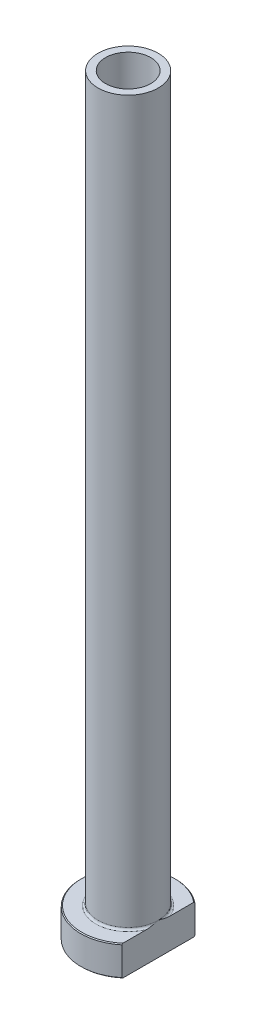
ISO-10303-21;
HEADER;
FILE_DESCRIPTION(('STEP AP214'),'2;1');
FILE_NAME('part.step','',(''),(''),'','','');
FILE_SCHEMA(('AUTOMOTIVE_DESIGN { 1 0 10303 214 1 1 1 1 }'));
ENDSEC;
DATA;
#1=APPLICATION_CONTEXT('core data for automotive mechanical design processes');
#2=APPLICATION_PROTOCOL_DEFINITION('international standard','automotive_design',2000,#1);
#3=PRODUCT_CONTEXT('',#1,'mechanical');
#4=PRODUCT('Part','Part','',(#3));
#5=PRODUCT_RELATED_PRODUCT_CATEGORY('part','',(#4));
#6=PRODUCT_DEFINITION_FORMATION('','',#4);
#7=PRODUCT_DEFINITION_CONTEXT('part definition',#1,'design');
#8=PRODUCT_DEFINITION('design','',#6,#7);
#9=PRODUCT_DEFINITION_SHAPE('','',#8);
#10=(LENGTH_UNIT() NAMED_UNIT(*) SI_UNIT(.MILLI.,.METRE.));
#11=(NAMED_UNIT(*) PLANE_ANGLE_UNIT() SI_UNIT($,.RADIAN.));
#12=(NAMED_UNIT(*) SI_UNIT($,.STERADIAN.) SOLID_ANGLE_UNIT());
#13=UNCERTAINTY_MEASURE_WITH_UNIT(LENGTH_MEASURE(1.E-05),#10,'distance_accuracy_value','');
#14=(GEOMETRIC_REPRESENTATION_CONTEXT(3) GLOBAL_UNCERTAINTY_ASSIGNED_CONTEXT((#13)) GLOBAL_UNIT_ASSIGNED_CONTEXT((#10,
#11,#12)) REPRESENTATION_CONTEXT('',''));
#15=CARTESIAN_POINT('',(0.,0.,0.));
#16=DIRECTION('',(0.,0.,1.));
#17=DIRECTION('',(1.,0.,0.));
#18=AXIS2_PLACEMENT_3D('',#15,#16,#17);
#19=CARTESIAN_POINT('',(0.,92.1876809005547,0.));
#20=DIRECTION('',(0.,1.,0.));
#21=DIRECTION('',(0.,0.,1.));
#22=AXIS2_PLACEMENT_3D('',#19,#20,#21);
#23=CYLINDRICAL_SURFACE('',#22,5.25);
#24=CARTESIAN_POINT('',(0.,175.,0.));
#25=DIRECTION('',(0.,1.,0.));
#26=DIRECTION('',(0.,0.,1.));
#27=AXIS2_PLACEMENT_3D('',#24,#25,#26);
#28=CIRCLE('',#27,5.25);
#29=CARTESIAN_POINT('',(0.,175.,5.25));
#30=VERTEX_POINT('',#29);
#31=EDGE_CURVE('E167',#30,#30,#28,.T.);
#32=ORIENTED_EDGE('',*,*,#31,.T.);
#33=EDGE_LOOP('',(#32));
#34=FACE_BOUND('',#33,.T.);
#35=CARTESIAN_POINT('',(0.,120.,0.));
#36=DIRECTION('',(0.,1.,0.));
#37=DIRECTION('',(0.,0.,1.));
#38=AXIS2_PLACEMENT_3D('',#35,#36,#37);
#39=CIRCLE('',#38,5.25);
#40=CARTESIAN_POINT('',(0.,120.,5.25));
#41=VERTEX_POINT('',#40);
#42=EDGE_CURVE('E170',#41,#41,#39,.T.);
#43=ORIENTED_EDGE('',*,*,#42,.F.);
#44=EDGE_LOOP('',(#43));
#45=FACE_BOUND('',#44,.T.);
#46=ADVANCED_FACE('F32',(#34,#45),#23,.F.);
#47=CARTESIAN_POINT('',(-5.25,175.,0.));
#48=DIRECTION('',(0.,1.,0.));
#49=DIRECTION('',(0.,0.,1.));
#50=AXIS2_PLACEMENT_3D('',#47,#48,#49);
#51=PLANE('',#50);
#52=CARTESIAN_POINT('',(0.,175.,0.));
#53=DIRECTION('',(0.,1.,0.));
#54=DIRECTION('',(0.,0.,1.));
#55=AXIS2_PLACEMENT_3D('',#52,#53,#54);
#56=CIRCLE('',#55,7.00000000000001);
#57=CARTESIAN_POINT('',(0.,175.,7.00000000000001));
#58=VERTEX_POINT('',#57);
#59=EDGE_CURVE('E174',#58,#58,#56,.T.);
#60=ORIENTED_EDGE('',*,*,#59,.T.);
#61=EDGE_LOOP('',(#60));
#62=FACE_BOUND('',#61,.T.);
#63=ORIENTED_EDGE('',*,*,#31,.F.);
#64=EDGE_LOOP('',(#63));
#65=FACE_BOUND('',#64,.T.);
#66=ADVANCED_FACE('F157',(#62,#65),#51,.T.);
#67=CARTESIAN_POINT('',(0.,92.1876809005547,0.));
#68=DIRECTION('',(0.,1.,0.));
#69=DIRECTION('',(0.,0.,1.));
#70=AXIS2_PLACEMENT_3D('',#67,#68,#69);
#71=CYLINDRICAL_SURFACE('',#70,7.);
#72=CARTESIAN_POINT('',(0.,7.50000000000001,0.));
#73=DIRECTION('',(0.,1.,0.));
#74=DIRECTION('',(0.,0.,1.));
#75=AXIS2_PLACEMENT_3D('',#72,#73,#74);
#76=CIRCLE('',#75,7.);
#77=CARTESIAN_POINT('',(7.,7.50000000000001,0.));
#78=VERTEX_POINT('',#77);
#79=EDGE_CURVE('E180',#78,#78,#76,.T.);
#80=ORIENTED_EDGE('',*,*,#79,.T.);
#81=EDGE_LOOP('',(#80));
#82=FACE_BOUND('',#81,.T.);
#83=ORIENTED_EDGE('',*,*,#59,.F.);
#84=EDGE_LOOP('',(#83));
#85=FACE_BOUND('',#84,.T.);
#86=ADVANCED_FACE('F162',(#82,#85),#71,.T.);
#87=CARTESIAN_POINT('',(-6.99999999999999,7.,0.));
#88=DIRECTION('',(0.,1.,0.));
#89=DIRECTION('',(0.,0.,1.));
#90=AXIS2_PLACEMENT_3D('',#87,#88,#89);
#91=PLANE('',#90);
#92=DIRECTION('',(0.,0.,1.));
#93=VECTOR('',#92,1.);
#94=CARTESIAN_POINT('',(6.99999999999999,7.,0.));
#95=LINE('',#94,#93);
#96=CARTESIAN_POINT('',(7.,7.,-8.22435407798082));
#97=VERTEX_POINT('',#96);
#98=CARTESIAN_POINT('',(6.99999999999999,7.,-2.69258240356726));
#99=VERTEX_POINT('',#98);
#100=EDGE_CURVE('E54',#97,#99,#95,.T.);
#101=ORIENTED_EDGE('',*,*,#100,.F.);
#102=CARTESIAN_POINT('',(0.,7.,0.));
#103=DIRECTION('',(0.,1.,0.));
#104=DIRECTION('',(0.,0.,1.));
#105=AXIS2_PLACEMENT_3D('',#102,#103,#104);
#106=CIRCLE('',#105,10.8);
#107=CARTESIAN_POINT('',(6.99999999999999,7.,8.22435407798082));
#108=VERTEX_POINT('',#107);
#109=EDGE_CURVE('E186',#97,#108,#106,.T.);
#110=ORIENTED_EDGE('',*,*,#109,.T.);
#111=CARTESIAN_POINT('',(6.99999999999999,7.,2.69258240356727));
#112=VERTEX_POINT('',#111);
#113=EDGE_CURVE('E134',#112,#108,#95,.T.);
#114=ORIENTED_EDGE('',*,*,#113,.F.);
#115=CARTESIAN_POINT('',(0.,7.,0.));
#116=DIRECTION('',(0.,1.,0.));
#117=DIRECTION('',(0.,0.,1.));
#118=AXIS2_PLACEMENT_3D('',#115,#116,#117);
#119=CIRCLE('',#118,7.5);
#120=EDGE_CURVE('E183',#112,#99,#119,.F.);
#121=ORIENTED_EDGE('',*,*,#120,.T.);
#122=EDGE_LOOP('',(#101,#110,#114,#121));
#123=FACE_BOUND('',#122,.T.);
#124=ADVANCED_FACE('F197',(#123),#91,.T.);
#125=CARTESIAN_POINT('',(0.,92.1876809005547,0.));
#126=DIRECTION('',(0.,1.,0.));
#127=DIRECTION('',(0.,0.,1.));
#128=AXIS2_PLACEMENT_3D('',#125,#126,#127);
#129=CYLINDRICAL_SURFACE('',#128,11.);
#130=DIRECTION('',(0.,-1.,0.));
#131=VECTOR('',#130,1.);
#132=CARTESIAN_POINT('',(6.99999999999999,175.,8.48528137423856));
#133=LINE('',#132,#131);
#134=CARTESIAN_POINT('',(6.99999999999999,6.8,8.48528137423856));
#135=VERTEX_POINT('',#134);
#136=CARTESIAN_POINT('',(6.99999999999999,0.199999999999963,8.48528137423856));
#137=VERTEX_POINT('',#136);
#138=EDGE_CURVE('E82',#135,#137,#133,.T.);
#139=ORIENTED_EDGE('',*,*,#138,.F.);
#140=CARTESIAN_POINT('',(0.,6.8,0.));
#141=DIRECTION('',(0.,1.,0.));
#142=DIRECTION('',(0.,0.,1.));
#143=AXIS2_PLACEMENT_3D('',#140,#141,#142);
#144=CIRCLE('',#143,11.);
#145=CARTESIAN_POINT('',(7.,6.8,-8.48528137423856));
#146=VERTEX_POINT('',#145);
#147=EDGE_CURVE('E95',#135,#146,#144,.F.);
#148=ORIENTED_EDGE('',*,*,#147,.T.);
#149=DIRECTION('',(0.,-1.,0.));
#150=VECTOR('',#149,1.);
#151=CARTESIAN_POINT('',(7.,175.,-8.48528137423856));
#152=LINE('',#151,#150);
#153=CARTESIAN_POINT('',(7.,0.199999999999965,-8.48528137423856));
#154=VERTEX_POINT('',#153);
#155=EDGE_CURVE('E192',#146,#154,#152,.T.);
#156=ORIENTED_EDGE('',*,*,#155,.T.);
#157=CARTESIAN_POINT('',(0.,0.199999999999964,0.));
#158=DIRECTION('',(0.,-1.,0.));
#159=DIRECTION('',(0.,0.,-1.));
#160=AXIS2_PLACEMENT_3D('',#157,#158,#159);
#161=CIRCLE('',#160,11.);
#162=EDGE_CURVE('E98',#154,#137,#161,.F.);
#163=ORIENTED_EDGE('',*,*,#162,.T.);
#164=EDGE_LOOP('',(#139,#148,#156,#163));
#165=FACE_BOUND('',#164,.T.);
#166=ADVANCED_FACE('F190',(#165),#129,.T.);
#167=CARTESIAN_POINT('',(-11.,0.,0.));
#168=DIRECTION('',(0.,-1.,0.));
#169=DIRECTION('',(0.,0.,-1.));
#170=AXIS2_PLACEMENT_3D('',#167,#168,#169);
#171=PLANE('',#170);
#172=CARTESIAN_POINT('',(0.,0.,0.));
#173=DIRECTION('',(0.,-1.,0.));
#174=DIRECTION('',(0.,0.,-1.));
#175=AXIS2_PLACEMENT_3D('',#172,#173,#174);
#176=CIRCLE('',#175,6.00000000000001);
#177=CARTESIAN_POINT('',(0.,0.,-6.00000000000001));
#178=VERTEX_POINT('',#177);
#179=EDGE_CURVE('E40',#178,#178,#176,.F.);
#180=ORIENTED_EDGE('',*,*,#179,.T.);
#181=EDGE_LOOP('',(#180));
#182=FACE_BOUND('',#181,.T.);
#183=DIRECTION('',(0.,0.,-1.));
#184=VECTOR('',#183,1.);
#185=CARTESIAN_POINT('',(6.99999999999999,0.,8.48528137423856));
#186=LINE('',#185,#184);
#187=CARTESIAN_POINT('',(6.99999999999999,0.,8.22435407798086));
#188=VERTEX_POINT('',#187);
#189=CARTESIAN_POINT('',(7.,0.,-8.22435407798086));
#190=VERTEX_POINT('',#189);
#191=EDGE_CURVE('E47',#188,#190,#186,.T.);
#192=ORIENTED_EDGE('',*,*,#191,.F.);
#193=CARTESIAN_POINT('',(0.,0.,0.));
#194=DIRECTION('',(0.,-1.,0.));
#195=DIRECTION('',(0.,0.,-1.));
#196=AXIS2_PLACEMENT_3D('',#193,#194,#195);
#197=CIRCLE('',#196,10.8);
#198=EDGE_CURVE('E92',#188,#190,#197,.T.);
#199=ORIENTED_EDGE('',*,*,#198,.T.);
#200=EDGE_LOOP('',(#192,#199));
#201=FACE_BOUND('',#200,.T.);
#202=ADVANCED_FACE('F91',(#182,#201),#171,.T.);
#203=CARTESIAN_POINT('',(0.,92.1876809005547,0.));
#204=DIRECTION('',(0.,1.,0.));
#205=DIRECTION('',(0.,0.,1.));
#206=AXIS2_PLACEMENT_3D('',#203,#204,#205);
#207=CYLINDRICAL_SURFACE('',#206,5.5);
#208=CARTESIAN_POINT('',(0.,0.499999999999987,0.));
#209=DIRECTION('',(0.,-1.,0.));
#210=DIRECTION('',(0.,0.,-1.));
#211=AXIS2_PLACEMENT_3D('',#208,#209,#210);
#212=CIRCLE('',#211,5.5);
#213=CARTESIAN_POINT('',(0.,0.499999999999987,-5.5));
#214=VERTEX_POINT('',#213);
#215=EDGE_CURVE('E11',#214,#214,#212,.T.);
#216=ORIENTED_EDGE('',*,*,#215,.T.);
#217=EDGE_LOOP('',(#216));
#218=FACE_BOUND('',#217,.T.);
#219=CARTESIAN_POINT('',(0.,108.,0.));
#220=DIRECTION('',(0.,1.,0.));
#221=DIRECTION('',(0.,0.,1.));
#222=AXIS2_PLACEMENT_3D('',#219,#220,#221);
#223=CIRCLE('',#222,5.5);
#224=CARTESIAN_POINT('',(0.,108.,5.5));
#225=VERTEX_POINT('',#224);
#226=EDGE_CURVE('E172',#225,#225,#223,.T.);
#227=ORIENTED_EDGE('',*,*,#226,.T.);
#228=EDGE_LOOP('',(#227));
#229=FACE_BOUND('',#228,.T.);
#230=ADVANCED_FACE('F215',(#218,#229),#207,.F.);
#231=CARTESIAN_POINT('',(0.,108.,0.));
#232=DIRECTION('',(0.,-1.,0.));
#233=DIRECTION('',(0.,0.,-1.));
#234=AXIS2_PLACEMENT_3D('',#231,#232,#233);
#235=CONICAL_SURFACE('',#234,5.5,0.0208303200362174);
#236=ORIENTED_EDGE('',*,*,#42,.T.);
#237=EDGE_LOOP('',(#236));
#238=FACE_BOUND('',#237,.T.);
#239=ORIENTED_EDGE('',*,*,#226,.F.);
#240=EDGE_LOOP('',(#239));
#241=FACE_BOUND('',#240,.T.);
#242=ADVANCED_FACE('F111',(#238,#241),#235,.F.);
#243=CARTESIAN_POINT('',(0.,7.50000000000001,0.));
#244=DIRECTION('',(0.,1.,0.));
#245=DIRECTION('',(0.,0.,1.));
#246=AXIS2_PLACEMENT_3D('',#243,#244,#245);
#247=TOROIDAL_SURFACE('',#246,7.5,0.5);
#248=ORIENTED_EDGE('',*,*,#120,.F.);
#249=CARTESIAN_POINT('',(7.,7.50000000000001,0.));
#250=CARTESIAN_POINT('',(7.,7.50000080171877,-1.25568479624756E-10));
#251=CARTESIAN_POINT('',(7.,7.50000160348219,2.9022028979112E-07));
#252=CARTESIAN_POINT('',(7.,7.50000310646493,1.10846445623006E-06));
#253=CARTESIAN_POINT('',(7.,7.50000379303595,1.65470117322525E-06));
#254=CARTESIAN_POINT('',(7.,7.50000521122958,2.96102760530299E-06));
#255=CARTESIAN_POINT('',(7.,7.50000592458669,3.74204187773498E-06));
#256=CARTESIAN_POINT('',(7.,7.50000721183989,5.36891885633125E-06));
#257=CARTESIAN_POINT('',(7.,7.50000778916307,6.21226355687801E-06));
#258=CARTESIAN_POINT('',(7.,7.50000990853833,9.44889721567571E-06));
#259=CARTESIAN_POINT('',(7.,7.50001133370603,1.19224915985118E-05));
#260=CARTESIAN_POINT('',(7.,7.50001370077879,1.68453050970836E-05));
#261=CARTESIAN_POINT('',(7.,7.50001467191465,1.92810864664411E-05));
#262=CARTESIAN_POINT('',(7.,7.5000187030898,2.95057529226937E-05));
#263=CARTESIAN_POINT('',(7.,7.50002167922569,3.73333827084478E-05));
#264=CARTESIAN_POINT('',(7.,7.5000261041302,5.21820419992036E-05));
#265=CARTESIAN_POINT('',(7.,7.50002771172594,5.91556020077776E-05));
#266=CARTESIAN_POINT('',(7.,7.50003935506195,0.000110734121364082));
#267=CARTESIAN_POINT('',(7.,7.50004810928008,0.000155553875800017));
#268=CARTESIAN_POINT('',(6.99999999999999,7.50008643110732,0.00033254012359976));
#269=CARTESIAN_POINT('',(6.99999999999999,7.50012307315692,0.000463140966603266));
#270=CARTESIAN_POINT('',(7.,7.50026565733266,0.000980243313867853));
#271=CARTESIAN_POINT('',(7.,7.50036696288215,0.00136762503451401));
#272=CARTESIAN_POINT('',(6.99999999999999,7.50077257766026,0.00290683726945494));
#273=CARTESIAN_POINT('',(6.99999999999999,7.5010826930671,0.00405753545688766));
#274=CARTESIAN_POINT('',(7.,7.50237341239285,0.00885983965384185));
#275=CARTESIAN_POINT('',(7.,7.50334676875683,0.0125128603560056));
#276=CARTESIAN_POINT('',(6.99999999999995,7.51627189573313,0.0610038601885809));
#277=CARTESIAN_POINT('',(6.99999999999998,7.52827280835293,0.105832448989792));
#278=CARTESIAN_POINT('',(7.00000000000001,7.551709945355,0.193693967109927));
#279=CARTESIAN_POINT('',(7.,7.56314936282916,0.236726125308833));
#280=CARTESIAN_POINT('',(6.99999999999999,7.58740418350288,0.328321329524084));
#281=CARTESIAN_POINT('',(6.99999999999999,7.60020832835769,0.376887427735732));
#282=CARTESIAN_POINT('',(7.,7.62578161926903,0.474605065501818));
#283=CARTESIAN_POINT('',(7.,7.63854879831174,0.523757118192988));
#284=CARTESIAN_POINT('',(6.99999999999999,7.66904753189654,0.642366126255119));
#285=CARTESIAN_POINT('',(7.,7.68665961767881,0.711854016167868));
#286=CARTESIAN_POINT('',(7.,7.72074501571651,0.849103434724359));
#287=CARTESIAN_POINT('',(7.,7.73723627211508,0.916860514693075));
#288=CARTESIAN_POINT('',(7.,7.79038156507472,1.1410421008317));
#289=CARTESIAN_POINT('',(7.,7.82528973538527,1.29788860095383));
#290=CARTESIAN_POINT('',(7.,7.88862298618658,1.61471917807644));
#291=CARTESIAN_POINT('',(7.,7.91697354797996,1.77471883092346));
#292=CARTESIAN_POINT('',(7.,7.95258292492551,2.02253505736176));
#293=CARTESIAN_POINT('',(7.,7.96355251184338,2.10981398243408));
#294=CARTESIAN_POINT('',(7.,7.98165287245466,2.28476193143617));
#295=CARTESIAN_POINT('',(7.,7.98878459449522,2.37243085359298));
#296=CARTESIAN_POINT('',(7.,7.99822919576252,2.54760327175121));
#297=CARTESIAN_POINT('',(7.,8.00056589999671,2.63510541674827));
#298=CARTESIAN_POINT('',(7.,7.99919996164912,2.81004074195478));
#299=CARTESIAN_POINT('',(7.,7.99550272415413,2.89747391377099));
#300=CARTESIAN_POINT('',(7.,7.98391011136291,3.02882076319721));
#301=CARTESIAN_POINT('',(7.,7.9789723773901,3.0729968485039));
#302=CARTESIAN_POINT('',(7.,7.96665453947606,3.16105400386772));
#303=CARTESIAN_POINT('',(7.,7.9592724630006,3.20493480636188));
#304=CARTESIAN_POINT('',(7.,7.94168688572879,3.29163191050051));
#305=CARTESIAN_POINT('',(7.,7.93151559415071,3.3344546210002));
#306=CARTESIAN_POINT('',(7.,7.90768392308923,3.41909658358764));
#307=CARTESIAN_POINT('',(7.,7.89402748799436,3.46091691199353));
#308=CARTESIAN_POINT('',(7.,7.86214701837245,3.54331777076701));
#309=CARTESIAN_POINT('',(7.,7.84387618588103,3.58388050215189));
#310=CARTESIAN_POINT('',(7.,7.80145892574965,3.66184445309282));
#311=CARTESIAN_POINT('',(7.,7.77733569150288,3.69925738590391));
#312=CARTESIAN_POINT('',(7.,7.73714014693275,3.74836513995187));
#313=CARTESIAN_POINT('',(7.,7.72423208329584,3.76263695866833));
#314=CARTESIAN_POINT('',(7.,7.69673765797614,3.78951670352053));
#315=CARTESIAN_POINT('',(7.,7.68215013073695,3.80212346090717));
#316=CARTESIAN_POINT('',(7.,7.65099843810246,3.82514624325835));
#317=CARTESIAN_POINT('',(7.,7.63441049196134,3.83553078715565));
#318=CARTESIAN_POINT('',(7.,7.59955798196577,3.8529401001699));
#319=CARTESIAN_POINT('',(7.,7.58129885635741,3.85997533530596));
#320=CARTESIAN_POINT('',(7.,7.54906837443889,3.86837810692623));
#321=CARTESIAN_POINT('',(7.,7.53536870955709,3.87079233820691));
#322=CARTESIAN_POINT('',(7.,7.50775756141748,3.87325240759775));
#323=CARTESIAN_POINT('',(7.,7.4938461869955,3.87329942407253));
#324=CARTESIAN_POINT('',(7.,7.46623771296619,3.87102093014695));
#325=CARTESIAN_POINT('',(7.,7.45254041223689,3.8686978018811));
#326=CARTESIAN_POINT('',(7.,7.42569741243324,3.86188775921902));
#327=CARTESIAN_POINT('',(7.,7.41255212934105,3.85739924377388));
#328=CARTESIAN_POINT('',(7.,7.3825931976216,3.84468786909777));
#329=CARTESIAN_POINT('',(7.,7.36610215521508,3.83570823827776));
#330=CARTESIAN_POINT('',(7.,7.33476729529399,3.81523202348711));
#331=CARTESIAN_POINT('',(7.,7.31992737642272,3.80372966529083));
#332=CARTESIAN_POINT('',(7.,7.28371925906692,3.77170797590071));
#333=CARTESIAN_POINT('',(7.,7.26356272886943,3.74983059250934));
#334=CARTESIAN_POINT('',(7.,7.22671696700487,3.70338283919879));
#335=CARTESIAN_POINT('',(7.,7.2100336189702,3.67880800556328));
#336=CARTESIAN_POINT('',(7.,7.18026553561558,3.62921731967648));
#337=CARTESIAN_POINT('',(7.,7.16704475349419,3.60428175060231));
#338=CARTESIAN_POINT('',(7.,7.14275069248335,3.55337478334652));
#339=CARTESIAN_POINT('',(7.,7.1316794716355,3.52740242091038));
#340=CARTESIAN_POINT('',(7.,7.10104499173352,3.44809573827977));
#341=CARTESIAN_POINT('',(7.,7.08424174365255,3.39369851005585));
#342=CARTESIAN_POINT('',(7.,7.05431378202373,3.27667221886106));
#343=CARTESIAN_POINT('',(7.,7.04191718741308,3.21386807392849));
#344=CARTESIAN_POINT('',(7.,7.02234605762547,3.08735184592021));
#345=CARTESIAN_POINT('',(7.,7.01518234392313,3.0236381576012));
#346=CARTESIAN_POINT('',(7.,7.00517826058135,2.8977900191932));
#347=CARTESIAN_POINT('',(7.,7.00221627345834,2.8356646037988));
#348=CARTESIAN_POINT('',(7.,6.99952325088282,2.71160626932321));
#349=CARTESIAN_POINT('',(7.,6.99977918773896,2.64967358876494));
#350=CARTESIAN_POINT('',(7.,7.00377761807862,2.49407814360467));
#351=CARTESIAN_POINT('',(7.,7.00924384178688,2.40046113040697));
#352=CARTESIAN_POINT('',(7.,7.02494106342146,2.21367396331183));
#353=CARTESIAN_POINT('',(7.,7.0351710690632,2.12050372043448));
#354=CARTESIAN_POINT('',(7.,7.05969765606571,1.93249035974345));
#355=CARTESIAN_POINT('',(7.,7.07408383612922,1.83765914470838));
#356=CARTESIAN_POINT('',(7.,7.1060330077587,1.6482934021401));
#357=CARTESIAN_POINT('',(7.,7.12360402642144,1.55376025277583));
#358=CARTESIAN_POINT('',(7.,7.16806468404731,1.33086107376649));
#359=CARTESIAN_POINT('',(7.,7.19601783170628,1.20270896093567));
#360=CARTESIAN_POINT('',(7.,7.25475947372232,0.948586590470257));
#361=CARTESIAN_POINT('',(7.,7.28551257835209,0.822607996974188));
#362=CARTESIAN_POINT('',(7.,7.33123897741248,0.64133402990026));
#363=CARTESIAN_POINT('',(7.,7.34543722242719,0.585840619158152));
#364=CARTESIAN_POINT('',(6.99999999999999,7.37418243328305,0.474686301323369));
#365=CARTESIAN_POINT('',(6.99999999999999,7.38873064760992,0.419025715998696));
#366=CARTESIAN_POINT('',(7.,7.41873357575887,0.305011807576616));
#367=CARTESIAN_POINT('',(7.,7.43419762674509,0.246660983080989));
#368=CARTESIAN_POINT('',(6.99999999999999,7.46502361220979,0.130933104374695));
#369=CARTESIAN_POINT('',(6.99999999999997,7.48038319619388,0.073555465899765));
#370=CARTESIAN_POINT('',(7.,7.49665455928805,0.0125077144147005));
#371=CARTESIAN_POINT('',(7.,7.49762931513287,0.00884956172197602));
#372=CARTESIAN_POINT('',(6.99999999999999,7.49892036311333,0.00404608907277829));
#373=CARTESIAN_POINT('',(6.99999999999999,7.49922940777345,0.00289935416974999));
#374=CARTESIAN_POINT('',(7.,7.49963371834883,0.00136508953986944));
#375=CARTESIAN_POINT('',(7.,7.49973476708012,0.000978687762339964));
#376=CARTESIAN_POINT('',(6.99999999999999,7.49987704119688,0.00046273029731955));
#377=CARTESIAN_POINT('',(6.99999999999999,7.4999136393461,0.000332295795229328));
#378=CARTESIAN_POINT('',(7.,7.49995192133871,0.000155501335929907));
#379=CARTESIAN_POINT('',(7.,7.49996067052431,0.000110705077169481));
#380=CARTESIAN_POINT('',(7.,7.49997230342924,5.91504871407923E-05));
#381=CARTESIAN_POINT('',(7.,7.49997390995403,5.21782476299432E-05));
#382=CARTESIAN_POINT('',(7.,7.49997833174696,3.73322821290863E-05));
#383=CARTESIAN_POINT('',(7.,7.49998130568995,2.95059555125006E-05));
#384=CARTESIAN_POINT('',(7.,7.49998533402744,1.92826357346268E-05));
#385=CARTESIAN_POINT('',(7.,7.49998630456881,1.68469531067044E-05));
#386=CARTESIAN_POINT('',(7.,7.49998867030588,1.19242379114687E-05));
#387=CARTESIAN_POINT('',(7.,7.49999009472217,9.45063101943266E-06));
#388=CARTESIAN_POINT('',(7.,7.49999221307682,6.21386478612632E-06));
#389=CARTESIAN_POINT('',(7.,7.4999927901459,5.37045339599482E-06));
#390=CARTESIAN_POINT('',(7.,7.49999407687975,3.74339717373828E-06));
#391=CARTESIAN_POINT('',(7.,7.49999478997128,2.96226879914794E-06));
#392=CARTESIAN_POINT('',(7.,7.49999620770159,1.65567359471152E-06));
#393=CARTESIAN_POINT('',(7.,7.49999689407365,1.10929204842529E-06));
#394=CARTESIAN_POINT('',(7.,7.49999839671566,2.90683225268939E-07));
#395=CARTESIAN_POINT('',(7.,7.49999919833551,1.25561410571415E-10));
#396=CARTESIAN_POINT('',(7.,7.50000000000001,0.));
#397=B_SPLINE_CURVE_WITH_KNOTS('',3,(#249,#250,#251,#252,#253,#254,#255,#256,#257,#258,#259,
#260,#261,#262,#263,#264,#265,#266,#267,#268,#269,#270,#271,#272,#273,#274,#275,#276,#277,#278,
#279,#280,#281,#282,#283,#284,#285,#286,#287,#288,#289,#290,#291,#292,#293,#294,#295,#296,#297,
#298,#299,#300,#301,#302,#303,#304,#305,#306,#307,#308,#309,#310,#311,#312,#313,#314,#315,#316,
#317,#318,#319,#320,#321,#322,#323,#324,#325,#326,#327,#328,#329,#330,#331,#332,#333,#334,#335,
#336,#337,#338,#339,#340,#341,#342,#343,#344,#345,#346,#347,#348,#349,#350,#351,#352,#353,#354,
#355,#356,#357,#358,#359,#360,#361,#362,#363,#364,#365,#366,#367,#368,#369,#370,#371,#372,#373,
#374,#375,#376,#377,#378,#379,#380,#381,#382,#383,#384,#385,#386,#387,#388,#389,#390,#391,#392,
#393,#394,#395,#396),.UNSPECIFIED.,.T.,.F.,(4,2,2,2,2,2,2,2,2,2,2,2,2,2,2,2,2,2,2,2,2,2,2,2,2,2,
2,2,2,2,2,2,2,2,2,2,2,2,2,2,2,2,2,2,2,2,2,2,2,2,2,2,2,2,2,2,2,2,2,2,2,2,2,2,2,2,2,2,2,2,2,2,2,
4),(0.,2.42201381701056E-06,5.0530479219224E-06,8.20814016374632E-06,1.12722920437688E-05,
1.98044004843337E-05,2.76642048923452E-05,5.27403832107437E-05,7.41830767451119E-05,
0.000211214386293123,0.000617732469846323,0.00181938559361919,0.00539412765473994,
0.016736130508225,0.155952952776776,0.2895341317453,0.440210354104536,0.592559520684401,
0.807611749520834,1.0168149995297,1.49878389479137,1.98598665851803,2.24981935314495,
2.5135868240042,2.77604050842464,3.03825922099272,3.17156039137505,3.3049693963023,
3.43689837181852,3.5686786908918,3.70185328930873,3.83450849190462,3.89212877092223,
3.94978928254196,4.00821928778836,4.06646549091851,4.10801107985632,4.14953598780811,
4.19101920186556,4.23253313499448,4.28854866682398,4.34469377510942,4.4334341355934,
4.52232362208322,4.60686785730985,4.69149264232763,4.86185145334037,5.05362927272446,
5.24580256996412,5.43229132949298,5.61802533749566,5.89918385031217,6.18028382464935,
6.46796485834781,6.75638131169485,7.14981284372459,7.53882346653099,7.71066604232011,
7.88325629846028,8.0643532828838,8.24254095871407,8.25389891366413,8.25746134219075,
8.25865995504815,8.25906595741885,8.25920291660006,8.25922435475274,8.25924942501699,
8.25925728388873,8.25926581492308,8.25926887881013,8.25927203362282,8.25927466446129,
8.25927708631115),.UNSPECIFIED.);
#398=EDGE_CURVE('E126',#112,#78,#397,.T.);
#399=ORIENTED_EDGE('',*,*,#398,.T.);
#400=ORIENTED_EDGE('',*,*,#79,.F.);
#401=CARTESIAN_POINT('',(7.,7.50000000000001,0.));
#402=CARTESIAN_POINT('',(7.,7.49999919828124,1.25569885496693E-10));
#403=CARTESIAN_POINT('',(7.,7.49999839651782,-2.90220288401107E-07));
#404=CARTESIAN_POINT('',(7.,7.49999689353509,-1.10846445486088E-06));
#405=CARTESIAN_POINT('',(7.,7.49999620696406,-1.65470117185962E-06));
#406=CARTESIAN_POINT('',(7.,7.49999478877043,-2.96102760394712E-06));
#407=CARTESIAN_POINT('',(7.,7.49999407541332,-3.7420418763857E-06));
#408=CARTESIAN_POINT('',(7.,7.49999278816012,-5.36891885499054E-06));
#409=CARTESIAN_POINT('',(7.,7.49999221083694,-6.2122635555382E-06));
#410=CARTESIAN_POINT('',(7.,7.49999009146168,-9.44889721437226E-06));
#411=CARTESIAN_POINT('',(7.,7.49998866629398,-1.19224915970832E-05));
#412=CARTESIAN_POINT('',(7.,7.49998629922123,-1.68453050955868E-05));
#413=CARTESIAN_POINT('',(7.,7.49998532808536,-1.92810864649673E-05));
#414=CARTESIAN_POINT('',(7.,7.49998129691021,-2.950575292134E-05));
#415=CARTESIAN_POINT('',(7.,7.49997832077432,-3.73333827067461E-05));
#416=CARTESIAN_POINT('',(7.,7.49997389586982,-5.21820419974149E-05));
#417=CARTESIAN_POINT('',(7.,7.49997228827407,-5.91556020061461E-05));
#418=CARTESIAN_POINT('',(7.,7.49996064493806,-0.000110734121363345));
#419=CARTESIAN_POINT('',(7.,7.49995189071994,-0.000155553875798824));
#420=CARTESIAN_POINT('',(6.99999999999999,7.49991356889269,-0.000332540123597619));
#421=CARTESIAN_POINT('',(6.99999999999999,7.49987692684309,-0.00046314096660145));
#422=CARTESIAN_POINT('',(7.,7.49973434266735,-0.000980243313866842));
#423=CARTESIAN_POINT('',(7.,7.49963303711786,-0.00136762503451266));
#424=CARTESIAN_POINT('',(6.99999999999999,7.49922742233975,-0.0029068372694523));
#425=CARTESIAN_POINT('',(6.99999999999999,7.49891730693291,-0.00405753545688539));
#426=CARTESIAN_POINT('',(7.,7.49762658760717,-0.00885983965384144));
#427=CARTESIAN_POINT('',(7.,7.49665323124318,-0.0125128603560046));
#428=CARTESIAN_POINT('',(6.99999999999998,7.48372810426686,-0.0610038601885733));
#429=CARTESIAN_POINT('',(6.99999999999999,7.47172719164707,-0.105832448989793));
#430=CARTESIAN_POINT('',(7.,7.44829005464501,-0.193693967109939));
#431=CARTESIAN_POINT('',(7.,7.43685063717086,-0.236726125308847));
#432=CARTESIAN_POINT('',(6.99999999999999,7.41259581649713,-0.328321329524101));
#433=CARTESIAN_POINT('',(7.,7.39979167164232,-0.376887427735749));
#434=CARTESIAN_POINT('',(7.,7.37421838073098,-0.474605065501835));
#435=CARTESIAN_POINT('',(7.,7.36145120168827,-0.523757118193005));
#436=CARTESIAN_POINT('',(7.,7.33095246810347,-0.642366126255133));
#437=CARTESIAN_POINT('',(7.,7.3133403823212,-0.711854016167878));
#438=CARTESIAN_POINT('',(7.,7.2792549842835,-0.849103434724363));
#439=CARTESIAN_POINT('',(7.,7.26276372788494,-0.916860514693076));
#440=CARTESIAN_POINT('',(7.,7.20961843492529,-1.1410421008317));
#441=CARTESIAN_POINT('',(7.,7.17471026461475,-1.29788860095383));
#442=CARTESIAN_POINT('',(7.,7.11137701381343,-1.61471917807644));
#443=CARTESIAN_POINT('',(7.,7.08302645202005,-1.77471883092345));
#444=CARTESIAN_POINT('',(7.,7.0474170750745,-2.02253505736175));
#445=CARTESIAN_POINT('',(7.,7.03644748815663,-2.10981398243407));
#446=CARTESIAN_POINT('',(7.,7.01834712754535,-2.28476193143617));
#447=CARTESIAN_POINT('',(7.,7.01121540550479,-2.37243085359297));
#448=CARTESIAN_POINT('',(7.,7.00177080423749,-2.5476032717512));
#449=CARTESIAN_POINT('',(7.,6.9994341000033,-2.63510541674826));
#450=CARTESIAN_POINT('',(7.,7.00080003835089,-2.81004074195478));
#451=CARTESIAN_POINT('',(7.,7.00449727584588,-2.89747391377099));
#452=CARTESIAN_POINT('',(7.,7.01608988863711,-3.02882076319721));
#453=CARTESIAN_POINT('',(7.,7.02102762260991,-3.0729968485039));
#454=CARTESIAN_POINT('',(7.,7.03334546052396,-3.16105400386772));
#455=CARTESIAN_POINT('',(7.,7.04072753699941,-3.20493480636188));
#456=CARTESIAN_POINT('',(7.,7.05831311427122,-3.29163191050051));
#457=CARTESIAN_POINT('',(7.,7.06848440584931,-3.3344546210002));
#458=CARTESIAN_POINT('',(7.,7.09231607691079,-3.41909658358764));
#459=CARTESIAN_POINT('',(7.,7.10597251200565,-3.46091691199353));
#460=CARTESIAN_POINT('',(7.,7.13785298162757,-3.54331777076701));
#461=CARTESIAN_POINT('',(7.,7.15612381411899,-3.58388050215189));
#462=CARTESIAN_POINT('',(7.,7.19854107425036,-3.66184445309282));
#463=CARTESIAN_POINT('',(7.,7.22266430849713,-3.69925738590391));
#464=CARTESIAN_POINT('',(7.,7.26285985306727,-3.74836513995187));
#465=CARTESIAN_POINT('',(7.,7.27576791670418,-3.76263695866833));
#466=CARTESIAN_POINT('',(7.,7.30326234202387,-3.78951670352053));
#467=CARTESIAN_POINT('',(7.,7.31784986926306,-3.80212346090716));
#468=CARTESIAN_POINT('',(7.,7.34900156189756,-3.82514624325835));
#469=CARTESIAN_POINT('',(7.,7.36558950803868,-3.83553078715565));
#470=CARTESIAN_POINT('',(7.,7.40044201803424,-3.8529401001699));
#471=CARTESIAN_POINT('',(7.,7.4187011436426,-3.85997533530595));
#472=CARTESIAN_POINT('',(7.,7.45093162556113,-3.86837810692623));
#473=CARTESIAN_POINT('',(7.,7.46463129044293,-3.87079233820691));
#474=CARTESIAN_POINT('',(7.,7.49224243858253,-3.87325240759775));
#475=CARTESIAN_POINT('',(7.,7.50615381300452,-3.87329942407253));
#476=CARTESIAN_POINT('',(7.,7.53376228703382,-3.87102093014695));
#477=CARTESIAN_POINT('',(7.,7.54745958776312,-3.8686978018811));
#478=CARTESIAN_POINT('',(7.,7.57430258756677,-3.86188775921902));
#479=CARTESIAN_POINT('',(7.,7.58744787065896,-3.85739924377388));
#480=CARTESIAN_POINT('',(7.,7.61740680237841,-3.84468786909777));
#481=CARTESIAN_POINT('',(7.,7.63389784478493,-3.83570823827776));
#482=CARTESIAN_POINT('',(7.,7.66523270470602,-3.81523202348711));
#483=CARTESIAN_POINT('',(7.,7.68007262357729,-3.80372966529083));
#484=CARTESIAN_POINT('',(7.,7.71628074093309,-3.77170797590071));
#485=CARTESIAN_POINT('',(7.,7.73643727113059,-3.74983059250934));
#486=CARTESIAN_POINT('',(7.,7.77328303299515,-3.70338283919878));
#487=CARTESIAN_POINT('',(7.,7.78996638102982,-3.67880800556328));
#488=CARTESIAN_POINT('',(7.,7.81973446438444,-3.62921731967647));
#489=CARTESIAN_POINT('',(7.,7.83295524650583,-3.6042817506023));
#490=CARTESIAN_POINT('',(7.,7.85724930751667,-3.55337478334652));
#491=CARTESIAN_POINT('',(7.,7.86832052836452,-3.52740242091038));
#492=CARTESIAN_POINT('',(7.,7.89895500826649,-3.44809573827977));
#493=CARTESIAN_POINT('',(7.,7.91575825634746,-3.39369851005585));
#494=CARTESIAN_POINT('',(7.,7.94568621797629,-3.27667221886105));
#495=CARTESIAN_POINT('',(7.,7.95808281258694,-3.21386807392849));
#496=CARTESIAN_POINT('',(7.,7.97765394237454,-3.0873518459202));
#497=CARTESIAN_POINT('',(7.,7.98481765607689,-3.02363815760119));
#498=CARTESIAN_POINT('',(7.,7.99482173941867,-2.89779001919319));
#499=CARTESIAN_POINT('',(7.,7.99778372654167,-2.83566460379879));
#500=CARTESIAN_POINT('',(7.,8.0004767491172,-2.71160626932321));
#501=CARTESIAN_POINT('',(7.,8.00022081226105,-2.64967358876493));
#502=CARTESIAN_POINT('',(7.,7.99622238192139,-2.49407814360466));
#503=CARTESIAN_POINT('',(7.,7.99075615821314,-2.40046113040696));
#504=CARTESIAN_POINT('',(7.,7.97505893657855,-2.21367396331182));
#505=CARTESIAN_POINT('',(7.,7.96482893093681,-2.12050372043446));
#506=CARTESIAN_POINT('',(7.,7.9403023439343,-1.93249035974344));
#507=CARTESIAN_POINT('',(7.,7.92591616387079,-1.83765914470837));
#508=CARTESIAN_POINT('',(7.,7.89396699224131,-1.64829340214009));
#509=CARTESIAN_POINT('',(7.,7.87639597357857,-1.55376025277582));
#510=CARTESIAN_POINT('',(7.,7.8319353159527,-1.33086107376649));
#511=CARTESIAN_POINT('',(7.,7.80398216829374,-1.20270896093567));
#512=CARTESIAN_POINT('',(7.,7.7452405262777,-0.948586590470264));
#513=CARTESIAN_POINT('',(7.,7.71448742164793,-0.822607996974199));
#514=CARTESIAN_POINT('',(7.,7.66876102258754,-0.641334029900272));
#515=CARTESIAN_POINT('',(7.,7.65456277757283,-0.585840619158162));
#516=CARTESIAN_POINT('',(6.99999999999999,7.62581756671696,-0.474686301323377));
#517=CARTESIAN_POINT('',(6.99999999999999,7.61126935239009,-0.419025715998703));
#518=CARTESIAN_POINT('',(7.,7.58126642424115,-0.305011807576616));
#519=CARTESIAN_POINT('',(7.,7.56580237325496,-0.246660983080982));
#520=CARTESIAN_POINT('',(6.99999999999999,7.53497638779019,-0.130933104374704));
#521=CARTESIAN_POINT('',(6.99999999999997,7.519616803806,-0.0735554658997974));
#522=CARTESIAN_POINT('',(7.,7.50334544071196,-0.0125077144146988));
#523=CARTESIAN_POINT('',(7.,7.50237068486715,-0.00884956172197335));
#524=CARTESIAN_POINT('',(6.99999999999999,7.50107963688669,-0.00404608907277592));
#525=CARTESIAN_POINT('',(6.99999999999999,7.50077059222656,-0.00289935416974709));
#526=CARTESIAN_POINT('',(7.,7.50036628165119,-0.00136508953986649));
#527=CARTESIAN_POINT('',(7.,7.50026523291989,-0.000978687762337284));
#528=CARTESIAN_POINT('',(6.99999999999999,7.50012295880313,-0.000462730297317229));
#529=CARTESIAN_POINT('',(6.99999999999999,7.50008636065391,-0.000332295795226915));
#530=CARTESIAN_POINT('',(7.,7.50004807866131,-0.000155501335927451));
#531=CARTESIAN_POINT('',(7.,7.50003932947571,-0.000110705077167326));
#532=CARTESIAN_POINT('',(7.,7.50002769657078,-5.91504871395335E-05));
#533=CARTESIAN_POINT('',(7.,7.50002609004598,-5.21782476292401E-05));
#534=CARTESIAN_POINT('',(7.,7.50002166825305,-3.73322821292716E-05));
#535=CARTESIAN_POINT('',(7.,7.50001869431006,-2.95059555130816E-05));
#536=CARTESIAN_POINT('',(7.,7.50001466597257,-1.9282635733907E-05));
#537=CARTESIAN_POINT('',(7.,7.5000136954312,-1.68469531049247E-05));
#538=CARTESIAN_POINT('',(7.,7.50001132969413,-1.19242379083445E-05));
#539=CARTESIAN_POINT('',(7.,7.50000990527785,-9.45063101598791E-06));
#540=CARTESIAN_POINT('',(7.,7.50000778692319,-6.21386478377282E-06));
#541=CARTESIAN_POINT('',(7.,7.50000720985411,-5.3704533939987E-06));
#542=CARTESIAN_POINT('',(7.,7.50000592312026,-3.74339717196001E-06));
#543=CARTESIAN_POINT('',(7.,7.50000521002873,-2.96226879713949E-06));
#544=CARTESIAN_POINT('',(7.,7.50000379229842,-1.65567359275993E-06));
#545=CARTESIAN_POINT('',(7.,7.50000310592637,-1.10929204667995E-06));
#546=CARTESIAN_POINT('',(7.,7.50000160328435,-2.9068322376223E-07));
#547=CARTESIAN_POINT('',(7.,7.5000008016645,-1.25559954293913E-10));
#548=CARTESIAN_POINT('',(7.,7.50000000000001,0.));
#549=B_SPLINE_CURVE_WITH_KNOTS('',3,(#401,#402,#403,#404,#405,#406,#407,#408,#409,#410,#411,
#412,#413,#414,#415,#416,#417,#418,#419,#420,#421,#422,#423,#424,#425,#426,#427,#428,#429,#430,
#431,#432,#433,#434,#435,#436,#437,#438,#439,#440,#441,#442,#443,#444,#445,#446,#447,#448,#449,
#450,#451,#452,#453,#454,#455,#456,#457,#458,#459,#460,#461,#462,#463,#464,#465,#466,#467,#468,
#469,#470,#471,#472,#473,#474,#475,#476,#477,#478,#479,#480,#481,#482,#483,#484,#485,#486,#487,
#488,#489,#490,#491,#492,#493,#494,#495,#496,#497,#498,#499,#500,#501,#502,#503,#504,#505,#506,
#507,#508,#509,#510,#511,#512,#513,#514,#515,#516,#517,#518,#519,#520,#521,#522,#523,#524,#525,
#526,#527,#528,#529,#530,#531,#532,#533,#534,#535,#536,#537,#538,#539,#540,#541,#542,#543,#544,
#545,#546,#547,#548),.UNSPECIFIED.,.T.,.F.,(4,2,2,2,2,2,2,2,2,2,2,2,2,2,2,2,2,2,2,2,2,2,2,2,2,2,
2,2,2,2,2,2,2,2,2,2,2,2,2,2,2,2,2,2,2,2,2,2,2,2,2,2,2,2,2,2,2,2,2,2,2,2,2,2,2,2,2,2,2,2,2,2,2,
4),(0.,2.42201381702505E-06,5.05304792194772E-06,8.20814016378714E-06,1.12722920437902E-05,
1.98044004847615E-05,2.7664204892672E-05,5.27403832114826E-05,7.41830767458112E-05,
0.000211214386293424,0.000617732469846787,0.00181938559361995,0.00539412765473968,
0.0167361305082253,0.155952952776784,0.289534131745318,0.440210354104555,0.592559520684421,
0.807611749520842,1.0168149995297,1.49878389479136,1.98598665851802,2.24981935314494,
2.5135868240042,2.77604050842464,3.03825922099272,3.17156039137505,3.3049693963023,
3.43689837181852,3.5686786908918,3.70185328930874,3.83450849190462,3.89212877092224,
3.94978928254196,4.00821928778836,4.06646549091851,4.10801107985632,4.14953598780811,
4.19101920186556,4.23253313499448,4.28854866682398,4.34469377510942,4.4334341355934,
4.52232362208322,4.60686785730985,4.69149264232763,4.86185145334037,5.05362927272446,
5.24580256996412,5.43229132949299,5.61802533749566,5.89918385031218,6.18028382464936,
6.46796485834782,6.75638131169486,7.14981284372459,7.53882346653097,7.7106660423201,
7.88325629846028,8.0643532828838,8.24254095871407,8.25389891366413,8.25746134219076,
8.25865995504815,8.25906595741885,8.25920291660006,8.25922435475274,8.25924942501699,
8.25925728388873,8.25926581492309,8.25926887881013,8.25927203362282,8.25927466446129,
8.25927708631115),.UNSPECIFIED.);
#550=EDGE_CURVE('E135',#78,#99,#549,.T.);
#551=ORIENTED_EDGE('',*,*,#550,.T.);
#552=EDGE_LOOP('',(#248,#399,#400,#551));
#553=FACE_BOUND('',#552,.T.);
#554=ADVANCED_FACE('F141',(#553),#247,.F.);
#555=CARTESIAN_POINT('',(0.,7.00000000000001,0.));
#556=DIRECTION('',(0.,-1.,0.));
#557=DIRECTION('',(0.,0.,-1.));
#558=AXIS2_PLACEMENT_3D('',#555,#556,#557);
#559=CONICAL_SURFACE('',#558,10.8,0.785398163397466);
#560=CARTESIAN_POINT('',(7.,-2.13774979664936,-18.6685261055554));
#561=CARTESIAN_POINT('',(7.,-1.86574872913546,-18.3780244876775));
#562=CARTESIAN_POINT('',(7.,-1.59415659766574,-18.0871392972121));
#563=CARTESIAN_POINT('',(7.,-1.05192877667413,-17.5044755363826));
#564=CARTESIAN_POINT('',(7.,-0.781293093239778,-17.2126969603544));
#565=CARTESIAN_POINT('',(7.,-0.241050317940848,-16.6280482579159));
#566=CARTESIAN_POINT('',(7.,0.02855648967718,-16.3351778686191));
#567=CARTESIAN_POINT('',(7.,0.566485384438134,-15.7482616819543));
#568=CARTESIAN_POINT('',(7.,0.834807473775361,-15.4542158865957));
#569=CARTESIAN_POINT('',(7.,1.64198377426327,-14.5651645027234));
#570=CARTESIAN_POINT('',(7.,2.17856420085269,-13.9680841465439));
#571=CARTESIAN_POINT('',(7.,2.97696333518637,-13.0668144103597));
#572=CARTESIAN_POINT('',(7.,3.24199785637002,-12.7654727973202));
#573=CARTESIAN_POINT('',(7.,3.76945856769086,-12.1605141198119));
#574=CARTESIAN_POINT('',(7.,4.0318847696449,-11.8568970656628));
#575=CARTESIAN_POINT('',(7.,4.50733797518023,-11.3009625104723));
#576=CARTESIAN_POINT('',(7.,4.72088020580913,-11.0490858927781));
#577=CARTESIAN_POINT('',(7.,5.14538078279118,-10.543165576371));
#578=CARTESIAN_POINT('',(7.,5.35633915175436,-10.2891218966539));
#579=CARTESIAN_POINT('',(7.,5.77522964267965,-9.77836737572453));
#580=CARTESIAN_POINT('',(7.,5.98316044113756,-9.52165544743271));
#581=CARTESIAN_POINT('',(7.,6.39521098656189,-9.00519084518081));
#582=CARTESIAN_POINT('',(7.,6.59933078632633,-8.74543821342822));
#583=CARTESIAN_POINT('',(7.,7.00243445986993,-8.22283607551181));
#584=CARTESIAN_POINT('',(7.,7.20142819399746,-7.95999419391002));
#585=CARTESIAN_POINT('',(7.,7.59353840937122,-7.42991856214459));
#586=CARTESIAN_POINT('',(7.,7.78665447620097,-7.16268450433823));
#587=CARTESIAN_POINT('',(7.,8.16523718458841,-6.62311113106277));
#588=CARTESIAN_POINT('',(7.,8.35070911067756,-6.35077553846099));
#589=CARTESIAN_POINT('',(7.,8.71189725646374,-5.79973731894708));
#590=CARTESIAN_POINT('',(7.,8.88761537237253,-5.5210359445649));
#591=CARTESIAN_POINT('',(7.,9.19554959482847,-5.00707921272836));
#592=CARTESIAN_POINT('',(7.,9.3298807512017,-4.77309669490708));
#593=CARTESIAN_POINT('',(7.,9.5876425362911,-4.29911523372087));
#594=CARTESIAN_POINT('',(7.,9.71107181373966,-4.05911554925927));
#595=CARTESIAN_POINT('',(7.,9.94390907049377,-3.57263619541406));
#596=CARTESIAN_POINT('',(7.,10.0533307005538,-3.32616312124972));
#597=CARTESIAN_POINT('',(7.,10.2545146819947,-2.82607166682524));
#598=CARTESIAN_POINT('',(7.,10.3462820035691,-2.57245532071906));
#599=CARTESIAN_POINT('',(7.,10.4907049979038,-2.11254447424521));
#600=CARTESIAN_POINT('',(7.,10.5475277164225,-1.90756611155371));
#601=CARTESIAN_POINT('',(7.,10.6452043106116,-1.49381161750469));
#602=CARTESIAN_POINT('',(7.,10.68606033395,-1.28503600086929));
#603=CARTESIAN_POINT('',(7.,10.7497550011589,-0.865342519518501));
#604=CARTESIAN_POINT('',(7.,10.7726462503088,-0.654432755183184));
#605=CARTESIAN_POINT('',(7.,10.7993569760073,-0.231396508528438));
#606=CARTESIAN_POINT('',(7.,10.8031771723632,-0.0192700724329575));
#607=CARTESIAN_POINT('',(7.,10.7915178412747,0.404715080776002));
#608=CARTESIAN_POINT('',(7.,10.7760135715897,0.61657310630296));
#609=CARTESIAN_POINT('',(7.,10.7265413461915,1.03810446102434));
#610=CARTESIAN_POINT('',(7.,10.6925718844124,1.24777761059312));
#611=CARTESIAN_POINT('',(7.,10.6077703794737,1.66430273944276));
#612=CARTESIAN_POINT('',(7.,10.5568873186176,1.87114418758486));
#613=CARTESIAN_POINT('',(7.,10.4404729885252,2.28061279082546));
#614=CARTESIAN_POINT('',(7.,10.3749414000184,2.48323985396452));
#615=CARTESIAN_POINT('',(7.,10.2190980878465,2.91860265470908));
#616=CARTESIAN_POINT('',(7.,10.1264616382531,3.15050038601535));
#617=CARTESIAN_POINT('',(7.,9.92740958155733,3.60835455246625));
#618=CARTESIAN_POINT('',(7.,9.82098769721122,3.83430822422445));
#619=CARTESIAN_POINT('',(7.,9.59695142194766,4.28105341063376));
#620=CARTESIAN_POINT('',(6.99999999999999,9.47931762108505,4.501835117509));
#621=CARTESIAN_POINT('',(6.99999999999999,9.23524231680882,4.93840249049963));
#622=CARTESIAN_POINT('',(6.99999999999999,9.1088020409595,5.1541888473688));
#623=CARTESIAN_POINT('',(6.99999999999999,8.84714657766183,5.58417945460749));
#624=CARTESIAN_POINT('',(6.99999999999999,8.71183920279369,5.79832734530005));
#625=CARTESIAN_POINT('',(6.99999999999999,8.43533082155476,6.22277635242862));
#626=CARTESIAN_POINT('',(6.99999999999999,8.29412966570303,6.43307737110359));
#627=CARTESIAN_POINT('',(6.99999999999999,8.00706556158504,6.85014007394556));
#628=CARTESIAN_POINT('',(6.99999999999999,7.86120763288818,7.05690522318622));
#629=CARTESIAN_POINT('',(6.99999999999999,7.56553131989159,7.4675727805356));
#630=CARTESIAN_POINT('',(6.99999999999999,7.41571298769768,7.67147522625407));
#631=CARTESIAN_POINT('',(6.99999999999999,7.07999705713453,8.12067189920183));
#632=CARTESIAN_POINT('',(6.99999999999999,6.89330819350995,8.36537403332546));
#633=CARTESIAN_POINT('',(6.99999999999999,6.51597189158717,8.85171196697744));
#634=CARTESIAN_POINT('',(6.99999999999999,6.32532432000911,9.09334766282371));
#635=CARTESIAN_POINT('',(6.99999999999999,5.94076020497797,9.57404667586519));
#636=CARTESIAN_POINT('',(6.99999999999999,5.74684327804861,9.81310968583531));
#637=CARTESIAN_POINT('',(6.99999999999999,5.35630729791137,10.2890203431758));
#638=CARTESIAN_POINT('',(6.99999999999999,5.15968820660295,10.5258679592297));
#639=CARTESIAN_POINT('',(6.99999999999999,4.56606953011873,11.2340330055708));
#640=CARTESIAN_POINT('',(6.99999999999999,4.16568148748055,11.7025100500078));
#641=CARTESIAN_POINT('',(6.99999999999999,3.35840033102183,12.633824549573));
#642=CARTESIAN_POINT('',(6.99999999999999,2.95150704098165,13.0966618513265));
#643=CARTESIAN_POINT('',(6.99999999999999,2.35017562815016,13.7734103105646));
#644=CARTESIAN_POINT('',(6.99999999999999,2.15763812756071,13.9890143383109));
#645=CARTESIAN_POINT('',(6.99999999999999,1.77161609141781,14.4193671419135));
#646=CARTESIAN_POINT('',(6.99999999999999,1.57813157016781,14.6341159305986));
#647=CARTESIAN_POINT('',(6.99999999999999,0.996412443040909,15.2772388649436));
#648=CARTESIAN_POINT('',(6.99999999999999,0.606922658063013,15.7044779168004));
#649=CARTESIAN_POINT('',(6.99999999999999,-0.173895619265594,16.5556520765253));
#650=CARTESIAN_POINT('',(6.99999999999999,-0.565218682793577,16.9795921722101));
#651=CARTESIAN_POINT('',(6.99999999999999,-1.34999931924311,17.8254589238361));
#652=CARTESIAN_POINT('',(6.99999999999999,-1.74345679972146,18.2473856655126));
#653=CARTESIAN_POINT('',(6.99999999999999,-2.13774979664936,18.6685261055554));
#654=B_SPLINE_CURVE_WITH_KNOTS('',3,(#560,#561,#562,#563,#564,#565,#566,#567,#568,#569,#570,
#571,#572,#573,#574,#575,#576,#577,#578,#579,#580,#581,#582,#583,#584,#585,#586,#587,#588,#589,
#590,#591,#592,#593,#594,#595,#596,#597,#598,#599,#600,#601,#602,#603,#604,#605,#606,#607,#608,
#609,#610,#611,#612,#613,#614,#615,#616,#617,#618,#619,#620,#621,#622,#623,#624,#625,#626,#627,
#628,#629,#630,#631,#632,#633,#634,#635,#636,#637,#638,#639,#640,#641,#642,#643,#644,#645,#646,
#647,#648,#649,#650,#651,#652,#653),.UNSPECIFIED.,.F.,.F.,(4,2,2,2,2,2,2,2,2,2,2,2,2,2,2,2,2,2,
2,2,2,2,2,2,2,2,2,2,2,2,2,2,2,2,2,2,2,2,2,2,2,2,2,2,2,2,4),(0.,1.19389386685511,
2.38779531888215,3.58200567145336,4.77621398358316,7.18442154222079,8.38834194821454,
9.5922568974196,10.5828886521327,11.5735117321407,12.5645555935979,13.5555857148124,
14.5445404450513,15.5335647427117,16.5218934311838,17.5100293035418,18.3192088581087,
19.1284885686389,19.9369735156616,20.7452305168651,21.3828127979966,22.020309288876,
22.6559319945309,23.2915307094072,23.9279440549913,24.5644093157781,25.2028120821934,
25.841228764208,26.5898097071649,27.3387327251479,28.0889766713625,28.8391162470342,
29.5989369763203,30.3587769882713,31.1178239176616,31.8768608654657,32.8001653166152,
33.7235009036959,34.6469455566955,35.5704032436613,37.419100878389,39.267848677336,
40.1350269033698,41.0021920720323,42.7365692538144,44.4673795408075,46.1981154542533),.UNSPECIFIED.);
#655=EDGE_CURVE('E133',#146,#97,#654,.T.);
#656=ORIENTED_EDGE('',*,*,#655,.F.);
#657=ORIENTED_EDGE('',*,*,#147,.F.);
#658=EDGE_CURVE('E118',#108,#135,#654,.T.);
#659=ORIENTED_EDGE('',*,*,#658,.F.);
#660=ORIENTED_EDGE('',*,*,#109,.F.);
#661=EDGE_LOOP('',(#656,#657,#659,#660));
#662=FACE_BOUND('',#661,.T.);
#663=ADVANCED_FACE('F145',(#662),#559,.T.);
#664=CARTESIAN_POINT('',(0.,0.199999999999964,0.));
#665=DIRECTION('',(0.,1.,0.));
#666=DIRECTION('',(0.,0.,1.));
#667=AXIS2_PLACEMENT_3D('',#664,#665,#666);
#668=CONICAL_SURFACE('',#667,11.,0.785398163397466);
#669=CARTESIAN_POINT('',(6.99999999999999,9.13774979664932,18.6685261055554));
#670=CARTESIAN_POINT('',(6.99999999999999,8.86574872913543,18.3780244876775));
#671=CARTESIAN_POINT('',(6.99999999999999,8.5941565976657,18.0871392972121));
#672=CARTESIAN_POINT('',(6.99999999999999,8.0519287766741,17.5044755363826));
#673=CARTESIAN_POINT('',(6.99999999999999,7.78129309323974,17.2126969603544));
#674=CARTESIAN_POINT('',(6.99999999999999,7.24105031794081,16.6280482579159));
#675=CARTESIAN_POINT('',(6.99999999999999,6.97144351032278,16.3351778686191));
#676=CARTESIAN_POINT('',(6.99999999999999,6.43351461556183,15.7482616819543));
#677=CARTESIAN_POINT('',(6.99999999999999,6.1651925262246,15.4542158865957));
#678=CARTESIAN_POINT('',(6.99999999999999,5.35801622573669,14.5651645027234));
#679=CARTESIAN_POINT('',(6.99999999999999,4.82143579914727,13.9680841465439));
#680=CARTESIAN_POINT('',(6.99999999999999,4.02303666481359,13.0668144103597));
#681=CARTESIAN_POINT('',(6.99999999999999,3.75800214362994,12.7654727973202));
#682=CARTESIAN_POINT('',(6.99999999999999,3.23054143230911,12.1605141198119));
#683=CARTESIAN_POINT('',(6.99999999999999,2.96811523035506,11.8568970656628));
#684=CARTESIAN_POINT('',(6.99999999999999,2.49266202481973,11.3009625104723));
#685=CARTESIAN_POINT('',(6.99999999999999,2.27911979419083,11.0490858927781));
#686=CARTESIAN_POINT('',(6.99999999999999,1.85461921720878,10.543165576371));
#687=CARTESIAN_POINT('',(6.99999999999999,1.6436608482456,10.2891218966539));
#688=CARTESIAN_POINT('',(6.99999999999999,1.22477035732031,9.77836737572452));
#689=CARTESIAN_POINT('',(6.99999999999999,1.0168395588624,9.52165544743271));
#690=CARTESIAN_POINT('',(6.99999999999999,0.604789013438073,9.00519084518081));
#691=CARTESIAN_POINT('',(6.99999999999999,0.400669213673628,8.74543821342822));
#692=CARTESIAN_POINT('',(6.99999999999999,-0.00243445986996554,8.22283607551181));
#693=CARTESIAN_POINT('',(6.99999999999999,-0.201428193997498,7.95999419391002));
#694=CARTESIAN_POINT('',(6.99999999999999,-0.593538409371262,7.42991856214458));
#695=CARTESIAN_POINT('',(6.99999999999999,-0.786654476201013,7.16268450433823));
#696=CARTESIAN_POINT('',(6.99999999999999,-1.16523718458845,6.62311113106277));
#697=CARTESIAN_POINT('',(6.99999999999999,-1.3507091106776,6.35077553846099));
#698=CARTESIAN_POINT('',(6.99999999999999,-1.71189725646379,5.79973731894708));
#699=CARTESIAN_POINT('',(6.99999999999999,-1.88761537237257,5.5210359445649));
#700=CARTESIAN_POINT('',(6.99999999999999,-2.19554959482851,5.00707921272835));
#701=CARTESIAN_POINT('',(6.99999999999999,-2.32988075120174,4.77309669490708));
#702=CARTESIAN_POINT('',(6.99999999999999,-2.58764253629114,4.29911523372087));
#703=CARTESIAN_POINT('',(7.,-2.7110718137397,4.05911554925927));
#704=CARTESIAN_POINT('',(7.,-2.94390907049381,3.57263619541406));
#705=CARTESIAN_POINT('',(7.,-3.05333070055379,3.32616312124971));
#706=CARTESIAN_POINT('',(7.,-3.25451468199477,2.82607166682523));
#707=CARTESIAN_POINT('',(7.,-3.3462820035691,2.57245532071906));
#708=CARTESIAN_POINT('',(7.,-3.49070499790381,2.11254447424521));
#709=CARTESIAN_POINT('',(7.,-3.54752771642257,1.90756611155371));
#710=CARTESIAN_POINT('',(7.,-3.64520431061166,1.49381161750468));
#711=CARTESIAN_POINT('',(7.,-3.68606033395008,1.28503600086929));
#712=CARTESIAN_POINT('',(7.,-3.74975500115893,0.865342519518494));
#713=CARTESIAN_POINT('',(7.,-3.77264625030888,0.654432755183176));
#714=CARTESIAN_POINT('',(7.,-3.79935697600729,0.23139650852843));
#715=CARTESIAN_POINT('',(7.,-3.80317717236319,0.0192700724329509));
#716=CARTESIAN_POINT('',(7.,-3.7915178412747,-0.404715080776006));
#717=CARTESIAN_POINT('',(7.,-3.77601357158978,-0.616573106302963));
#718=CARTESIAN_POINT('',(7.,-3.72654134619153,-1.03810446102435));
#719=CARTESIAN_POINT('',(7.,-3.69257188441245,-1.24777761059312));
#720=CARTESIAN_POINT('',(7.,-3.60777037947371,-1.66430273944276));
#721=CARTESIAN_POINT('',(7.,-3.55688731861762,-1.87114418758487));
#722=CARTESIAN_POINT('',(7.,-3.44047298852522,-2.28061279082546));
#723=CARTESIAN_POINT('',(7.,-3.37494140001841,-2.48323985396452));
#724=CARTESIAN_POINT('',(7.,-3.21909808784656,-2.91860265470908));
#725=CARTESIAN_POINT('',(7.,-3.12646163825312,-3.15050038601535));
#726=CARTESIAN_POINT('',(7.,-2.92740958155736,-3.60835455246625));
#727=CARTESIAN_POINT('',(7.,-2.82098769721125,-3.83430822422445));
#728=CARTESIAN_POINT('',(7.,-2.59695142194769,-4.28105341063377));
#729=CARTESIAN_POINT('',(7.,-2.47931762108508,-4.501835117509));
#730=CARTESIAN_POINT('',(7.,-2.23524231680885,-4.93840249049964));
#731=CARTESIAN_POINT('',(7.,-2.10880204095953,-5.1541888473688));
#732=CARTESIAN_POINT('',(7.,-1.84714657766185,-5.5841794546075));
#733=CARTESIAN_POINT('',(7.,-1.71183920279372,-5.79832734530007));
#734=CARTESIAN_POINT('',(7.,-1.43533082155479,-6.22277635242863));
#735=CARTESIAN_POINT('',(7.,-1.29412966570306,-6.4330773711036));
#736=CARTESIAN_POINT('',(7.,-1.00706556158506,-6.85014007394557));
#737=CARTESIAN_POINT('',(7.,-0.86120763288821,-7.05690522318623));
#738=CARTESIAN_POINT('',(7.,-0.565531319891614,-7.46757278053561));
#739=CARTESIAN_POINT('',(7.,-0.415712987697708,-7.67147522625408));
#740=CARTESIAN_POINT('',(7.,-0.0799970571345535,-8.12067189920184));
#741=CARTESIAN_POINT('',(7.,0.106691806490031,-8.36537403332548));
#742=CARTESIAN_POINT('',(7.,0.484028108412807,-8.85171196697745));
#743=CARTESIAN_POINT('',(7.,0.674675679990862,-9.09334766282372));
#744=CARTESIAN_POINT('',(7.,1.059239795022,-9.57404667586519));
#745=CARTESIAN_POINT('',(7.,1.25315672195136,-9.81310968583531));
#746=CARTESIAN_POINT('',(7.,1.6436927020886,-10.2890203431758));
#747=CARTESIAN_POINT('',(7.,1.84031179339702,-10.5258679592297));
#748=CARTESIAN_POINT('',(7.,2.43393046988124,-11.2340330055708));
#749=CARTESIAN_POINT('',(7.,2.83431851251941,-11.7025100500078));
#750=CARTESIAN_POINT('',(7.,3.64159966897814,-12.633824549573));
#751=CARTESIAN_POINT('',(7.,4.04849295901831,-13.0966618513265));
#752=CARTESIAN_POINT('',(7.,4.6498243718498,-13.7734103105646));
#753=CARTESIAN_POINT('',(7.,4.84236187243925,-13.9890143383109));
#754=CARTESIAN_POINT('',(7.,5.22838390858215,-14.4193671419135));
#755=CARTESIAN_POINT('',(7.,5.42186842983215,-14.6341159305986));
#756=CARTESIAN_POINT('',(7.,6.00358755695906,-15.2772388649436));
#757=CARTESIAN_POINT('',(7.,6.39307734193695,-15.7044779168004));
#758=CARTESIAN_POINT('',(7.,7.17389561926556,-16.5556520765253));
#759=CARTESIAN_POINT('',(7.,7.56521868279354,-16.9795921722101));
#760=CARTESIAN_POINT('',(7.,8.34999931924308,-17.8254589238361));
#761=CARTESIAN_POINT('',(7.,8.74345679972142,-18.2473856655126));
#762=CARTESIAN_POINT('',(7.,9.13774979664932,-18.6685261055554));
#763=B_SPLINE_CURVE_WITH_KNOTS('',3,(#669,#670,#671,#672,#673,#674,#675,#676,#677,#678,#679,
#680,#681,#682,#683,#684,#685,#686,#687,#688,#689,#690,#691,#692,#693,#694,#695,#696,#697,#698,
#699,#700,#701,#702,#703,#704,#705,#706,#707,#708,#709,#710,#711,#712,#713,#714,#715,#716,#717,
#718,#719,#720,#721,#722,#723,#724,#725,#726,#727,#728,#729,#730,#731,#732,#733,#734,#735,#736,
#737,#738,#739,#740,#741,#742,#743,#744,#745,#746,#747,#748,#749,#750,#751,#752,#753,#754,#755,
#756,#757,#758,#759,#760,#761,#762),.UNSPECIFIED.,.F.,.F.,(4,2,2,2,2,2,2,2,2,2,2,2,2,2,2,2,2,2,
2,2,2,2,2,2,2,2,2,2,2,2,2,2,2,2,2,2,2,2,2,2,2,2,2,2,2,2,4),(0.,1.19389386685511,
2.38779531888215,3.58200567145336,4.77621398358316,7.18442154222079,8.38834194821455,
9.59225689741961,10.5828886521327,11.5735117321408,12.5645555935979,13.5555857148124,
14.5445404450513,15.5335647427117,16.5218934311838,17.5100293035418,18.3192088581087,
19.1284885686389,19.9369735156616,20.7452305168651,21.3828127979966,22.020309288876,
22.6559319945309,23.2915307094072,23.9279440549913,24.5644093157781,25.2028120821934,
25.8412287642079,26.5898097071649,27.3387327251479,28.0889766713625,28.8391162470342,
29.5989369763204,30.3587769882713,31.1178239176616,31.8768608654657,32.8001653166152,
33.7235009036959,34.6469455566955,35.5704032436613,37.419100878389,39.267848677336,
40.1350269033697,41.0021920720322,42.7365692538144,44.4673795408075,46.1981154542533),.UNSPECIFIED.);
#764=EDGE_CURVE('E79',#137,#188,#763,.T.);
#765=ORIENTED_EDGE('',*,*,#764,.F.);
#766=ORIENTED_EDGE('',*,*,#162,.F.);
#767=EDGE_CURVE('E87',#190,#154,#763,.T.);
#768=ORIENTED_EDGE('',*,*,#767,.F.);
#769=ORIENTED_EDGE('',*,*,#198,.F.);
#770=EDGE_LOOP('',(#765,#766,#768,#769));
#771=FACE_BOUND('',#770,.T.);
#772=ADVANCED_FACE('F94',(#771),#668,.T.);
#773=CARTESIAN_POINT('',(6.99999999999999,175.,8.48528137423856));
#774=DIRECTION('',(-1.,0.,0.));
#775=DIRECTION('',(0.,0.,1.));
#776=AXIS2_PLACEMENT_3D('',#773,#774,#775);
#777=PLANE('',#776);
#778=ORIENTED_EDGE('',*,*,#398,.F.);
#779=ORIENTED_EDGE('',*,*,#113,.T.);
#780=ORIENTED_EDGE('',*,*,#658,.T.);
#781=ORIENTED_EDGE('',*,*,#138,.T.);
#782=ORIENTED_EDGE('',*,*,#764,.T.);
#783=ORIENTED_EDGE('',*,*,#191,.T.);
#784=ORIENTED_EDGE('',*,*,#767,.T.);
#785=ORIENTED_EDGE('',*,*,#155,.F.);
#786=ORIENTED_EDGE('',*,*,#655,.T.);
#787=ORIENTED_EDGE('',*,*,#100,.T.);
#788=ORIENTED_EDGE('',*,*,#550,.F.);
#789=EDGE_LOOP('',(#778,#779,#780,#781,#782,#783,#784,#785,#786,#787,#788));
#790=FACE_BOUND('',#789,.T.);
#791=ADVANCED_FACE('F80',(#790),#777,.F.);
#792=CARTESIAN_POINT('',(0.,0.,0.));
#793=DIRECTION('',(0.,-1.,0.));
#794=DIRECTION('',(0.,0.,-1.));
#795=AXIS2_PLACEMENT_3D('',#792,#793,#794);
#796=CONICAL_SURFACE('',#795,6.00000000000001,0.785398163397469);
#797=ORIENTED_EDGE('',*,*,#215,.F.);
#798=EDGE_LOOP('',(#797));
#799=FACE_BOUND('',#798,.T.);
#800=ORIENTED_EDGE('',*,*,#179,.F.);
#801=EDGE_LOOP('',(#800));
#802=FACE_BOUND('',#801,.T.);
#803=ADVANCED_FACE('F34',(#799,#802),#796,.F.);
#804=CLOSED_SHELL('',(#46,#66,#86,#124,#166,#202,#230,#242,#554,#663,#772,#791,#803));
#805=MANIFOLD_SOLID_BREP('B2',#804);
#806=ADVANCED_BREP_SHAPE_REPRESENTATION('',(#18,#805),#14);
#807=SHAPE_DEFINITION_REPRESENTATION(#9,#806);
ENDSEC;
END-ISO-10303-21;
